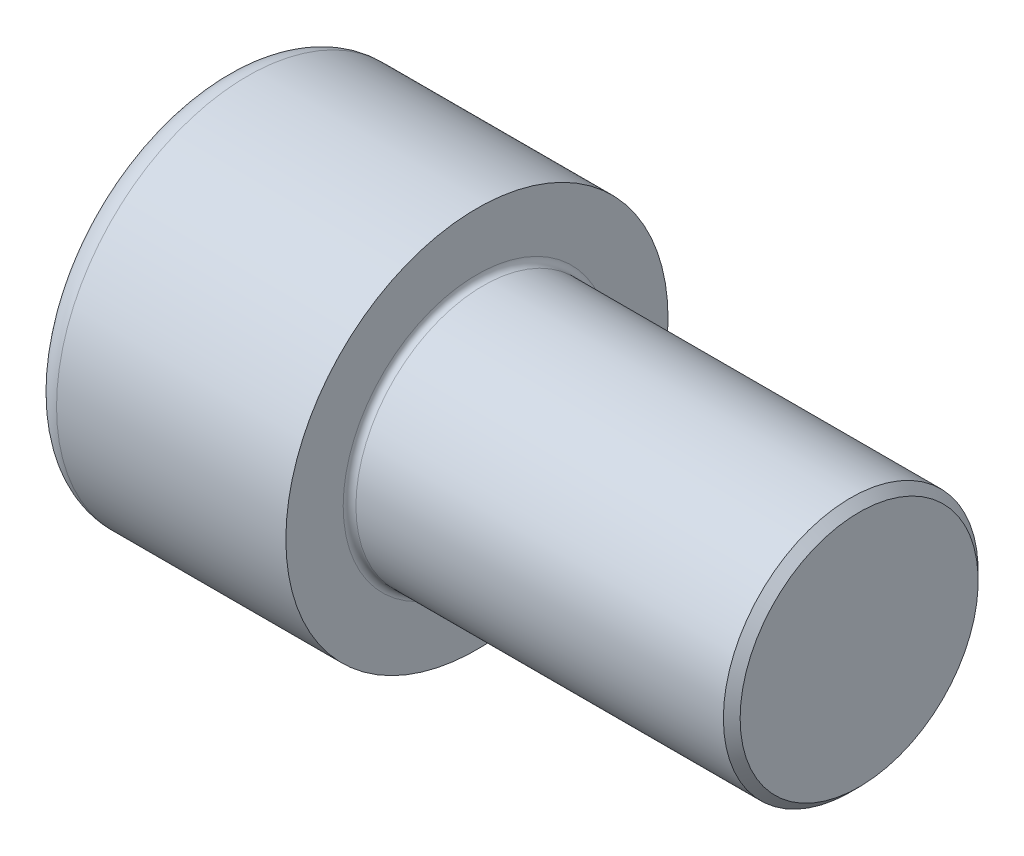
ISO-10303-21;
HEADER;
FILE_DESCRIPTION(('STEP AP214'),'2;1');
FILE_NAME('part.step','',(''),(''),'','','');
FILE_SCHEMA(('AUTOMOTIVE_DESIGN { 1 0 10303 214 1 1 1 1 }'));
ENDSEC;
DATA;
#1=APPLICATION_CONTEXT('core data for automotive mechanical design processes');
#2=APPLICATION_PROTOCOL_DEFINITION('international standard','automotive_design',2000,#1);
#3=PRODUCT_CONTEXT('',#1,'mechanical');
#4=PRODUCT('Part','Part','',(#3));
#5=PRODUCT_RELATED_PRODUCT_CATEGORY('part','',(#4));
#6=PRODUCT_DEFINITION_FORMATION('','',#4);
#7=PRODUCT_DEFINITION_CONTEXT('part definition',#1,'design');
#8=PRODUCT_DEFINITION('design','',#6,#7);
#9=PRODUCT_DEFINITION_SHAPE('','',#8);
#10=(LENGTH_UNIT() NAMED_UNIT(*) SI_UNIT(.MILLI.,.METRE.));
#11=(NAMED_UNIT(*) PLANE_ANGLE_UNIT() SI_UNIT($,.RADIAN.));
#12=(NAMED_UNIT(*) SI_UNIT($,.STERADIAN.) SOLID_ANGLE_UNIT());
#13=UNCERTAINTY_MEASURE_WITH_UNIT(LENGTH_MEASURE(1.E-05),#10,'distance_accuracy_value','');
#14=(GEOMETRIC_REPRESENTATION_CONTEXT(3) GLOBAL_UNCERTAINTY_ASSIGNED_CONTEXT((#13)) GLOBAL_UNIT_ASSIGNED_CONTEXT((#10,
#11,#12)) REPRESENTATION_CONTEXT('',''));
#15=CARTESIAN_POINT('',(0.,0.,0.));
#16=DIRECTION('',(0.,0.,1.));
#17=DIRECTION('',(1.,0.,0.));
#18=AXIS2_PLACEMENT_3D('',#15,#16,#17);
#19=CARTESIAN_POINT('',(0.,0.,0.));
#20=DIRECTION('',(-1.,0.,0.));
#21=DIRECTION('',(0.,0.,1.));
#22=AXIS2_PLACEMENT_3D('',#19,#20,#21);
#23=PLANE('',#22);
#24=DIRECTION('',(0.,-0.499999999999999,0.866025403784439));
#25=VECTOR('',#24,1.);
#26=CARTESIAN_POINT('',(0.,49.1440549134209,0.));
#27=LINE('',#26,#25);
#28=CARTESIAN_POINT('',(0.,49.1440549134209,0.));
#29=VERTEX_POINT('',#28);
#30=CARTESIAN_POINT('',(0.,24.5720274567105,42.56));
#31=VERTEX_POINT('',#30);
#32=EDGE_CURVE('E112',#29,#31,#27,.T.);
#33=ORIENTED_EDGE('',*,*,#32,.T.);
#34=DIRECTION('',(0.,1.,0.));
#35=VECTOR('',#34,1.);
#36=CARTESIAN_POINT('',(0.,-24.5720274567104,42.56));
#37=LINE('',#36,#35);
#38=CARTESIAN_POINT('',(0.,-24.5720274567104,42.56));
#39=VERTEX_POINT('',#38);
#40=EDGE_CURVE('E101',#39,#31,#37,.T.);
#41=ORIENTED_EDGE('',*,*,#40,.F.);
#42=DIRECTION('',(0.,-0.500000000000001,-0.866025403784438));
#43=VECTOR('',#42,1.);
#44=CARTESIAN_POINT('',(0.,-24.5720274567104,42.56));
#45=LINE('',#44,#43);
#46=CARTESIAN_POINT('',(0.,-49.1440549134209,0.));
#47=VERTEX_POINT('',#46);
#48=EDGE_CURVE('E111',#39,#47,#45,.T.);
#49=ORIENTED_EDGE('',*,*,#48,.T.);
#50=DIRECTION('',(0.,0.499999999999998,-0.86602540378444));
#51=VECTOR('',#50,1.);
#52=CARTESIAN_POINT('',(0.,-49.1440549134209,0.));
#53=LINE('',#52,#51);
#54=CARTESIAN_POINT('',(0.,-24.5720274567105,-42.56));
#55=VERTEX_POINT('',#54);
#56=EDGE_CURVE('E130',#47,#55,#53,.T.);
#57=ORIENTED_EDGE('',*,*,#56,.T.);
#58=DIRECTION('',(0.,-1.,0.));
#59=VECTOR('',#58,1.);
#60=CARTESIAN_POINT('',(0.,24.5720274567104,-42.56));
#61=LINE('',#60,#59);
#62=CARTESIAN_POINT('',(0.,24.5720274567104,-42.56));
#63=VERTEX_POINT('',#62);
#64=EDGE_CURVE('E133',#63,#55,#61,.T.);
#65=ORIENTED_EDGE('',*,*,#64,.F.);
#66=DIRECTION('',(0.,-0.500000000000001,-0.866025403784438));
#67=VECTOR('',#66,1.);
#68=CARTESIAN_POINT('',(0.,49.1440549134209,0.));
#69=LINE('',#68,#67);
#70=EDGE_CURVE('E126',#29,#63,#69,.T.);
#71=ORIENTED_EDGE('',*,*,#70,.F.);
#72=EDGE_LOOP('',(#33,#41,#49,#57,#65,#71));
#73=FACE_BOUND('',#72,.T.);
#74=CARTESIAN_POINT('',(0.,0.,0.));
#75=DIRECTION('',(-1.,0.,0.));
#76=DIRECTION('',(0.,0.,1.));
#77=AXIS2_PLACEMENT_3D('',#74,#75,#76);
#78=CIRCLE('',#77,65.);
#79=CARTESIAN_POINT('',(0.,0.,65.));
#80=VERTEX_POINT('',#79);
#81=EDGE_CURVE('E37',#80,#80,#78,.T.);
#82=ORIENTED_EDGE('',*,*,#81,.T.);
#83=EDGE_LOOP('',(#82));
#84=FACE_BOUND('',#83,.T.);
#85=ADVANCED_FACE('F30',(#73,#84),#23,.T.);
#86=CARTESIAN_POINT('',(-31.75,0.,0.));
#87=DIRECTION('',(-1.,0.,0.));
#88=DIRECTION('',(0.,0.,1.));
#89=AXIS2_PLACEMENT_3D('',#86,#87,#88);
#90=CYLINDRICAL_SURFACE('',#89,75.);
#91=CARTESIAN_POINT('',(10.,0.,0.));
#92=DIRECTION('',(-1.,0.,0.));
#93=DIRECTION('',(0.,0.,1.));
#94=AXIS2_PLACEMENT_3D('',#91,#92,#93);
#95=CIRCLE('',#94,75.);
#96=CARTESIAN_POINT('',(10.,0.,75.));
#97=VERTEX_POINT('',#96);
#98=EDGE_CURVE('E11',#97,#97,#95,.F.);
#99=ORIENTED_EDGE('',*,*,#98,.T.);
#100=EDGE_LOOP('',(#99));
#101=FACE_BOUND('',#100,.T.);
#102=CARTESIAN_POINT('',(100.,0.,0.));
#103=DIRECTION('',(-1.,0.,0.));
#104=DIRECTION('',(0.,0.,1.));
#105=AXIS2_PLACEMENT_3D('',#102,#103,#104);
#106=CIRCLE('',#105,75.);
#107=CARTESIAN_POINT('',(100.,0.,75.));
#108=VERTEX_POINT('',#107);
#109=EDGE_CURVE('E178',#108,#108,#106,.T.);
#110=ORIENTED_EDGE('',*,*,#109,.T.);
#111=EDGE_LOOP('',(#110));
#112=FACE_BOUND('',#111,.T.);
#113=ADVANCED_FACE('F205',(#101,#112),#90,.T.);
#114=CARTESIAN_POINT('',(100.,75.,0.));
#115=DIRECTION('',(1.,0.,0.));
#116=DIRECTION('',(0.,0.,-1.));
#117=AXIS2_PLACEMENT_3D('',#114,#115,#116);
#118=PLANE('',#117);
#119=CARTESIAN_POINT('',(100.,0.,0.));
#120=DIRECTION('',(1.,0.,0.));
#121=DIRECTION('',(0.,0.,-1.));
#122=AXIS2_PLACEMENT_3D('',#119,#120,#121);
#123=CIRCLE('',#122,52.5);
#124=CARTESIAN_POINT('',(100.,0.,-52.5));
#125=VERTEX_POINT('',#124);
#126=EDGE_CURVE('E181',#125,#125,#123,.F.);
#127=ORIENTED_EDGE('',*,*,#126,.T.);
#128=EDGE_LOOP('',(#127));
#129=FACE_BOUND('',#128,.T.);
#130=ORIENTED_EDGE('',*,*,#109,.F.);
#131=EDGE_LOOP('',(#130));
#132=FACE_BOUND('',#131,.T.);
#133=ADVANCED_FACE('F209',(#129,#132),#118,.T.);
#134=CARTESIAN_POINT('',(-31.75,0.,0.));
#135=DIRECTION('',(-1.,0.,0.));
#136=DIRECTION('',(0.,0.,1.));
#137=AXIS2_PLACEMENT_3D('',#134,#135,#136);
#138=CYLINDRICAL_SURFACE('',#137,50.);
#139=CARTESIAN_POINT('',(102.5,0.,0.));
#140=DIRECTION('',(1.,0.,0.));
#141=DIRECTION('',(0.,0.,-1.));
#142=AXIS2_PLACEMENT_3D('',#139,#140,#141);
#143=CIRCLE('',#142,50.);
#144=CARTESIAN_POINT('',(102.5,0.,-50.));
#145=VERTEX_POINT('',#144);
#146=EDGE_CURVE('E184',#145,#145,#143,.T.);
#147=ORIENTED_EDGE('',*,*,#146,.T.);
#148=EDGE_LOOP('',(#147));
#149=FACE_BOUND('',#148,.T.);
#150=CARTESIAN_POINT('',(246.7125,0.,0.));
#151=DIRECTION('',(-1.,0.,0.));
#152=DIRECTION('',(0.,0.,1.));
#153=AXIS2_PLACEMENT_3D('',#150,#151,#152);
#154=CIRCLE('',#153,50.);
#155=CARTESIAN_POINT('',(246.7125,0.,50.));
#156=VERTEX_POINT('',#155);
#157=EDGE_CURVE('E175',#156,#156,#154,.T.);
#158=ORIENTED_EDGE('',*,*,#157,.T.);
#159=EDGE_LOOP('',(#158));
#160=FACE_BOUND('',#159,.T.);
#161=ADVANCED_FACE('F214',(#149,#160),#138,.T.);
#162=CARTESIAN_POINT('',(250.,0.,0.));
#163=DIRECTION('',(-1.,0.,0.));
#164=DIRECTION('',(0.,0.,1.));
#165=AXIS2_PLACEMENT_3D('',#162,#163,#164);
#166=CONICAL_SURFACE('',#165,46.7125,0.785398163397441);
#167=ORIENTED_EDGE('',*,*,#157,.F.);
#168=EDGE_LOOP('',(#167));
#169=FACE_BOUND('',#168,.T.);
#170=CARTESIAN_POINT('',(250.,0.,0.));
#171=DIRECTION('',(-1.,0.,0.));
#172=DIRECTION('',(0.,0.,1.));
#173=AXIS2_PLACEMENT_3D('',#170,#171,#172);
#174=CIRCLE('',#173,46.7125);
#175=CARTESIAN_POINT('',(250.,0.,46.7125));
#176=VERTEX_POINT('',#175);
#177=EDGE_CURVE('E171',#176,#176,#174,.T.);
#178=ORIENTED_EDGE('',*,*,#177,.T.);
#179=EDGE_LOOP('',(#178));
#180=FACE_BOUND('',#179,.T.);
#181=ADVANCED_FACE('F221',(#169,#180),#166,.T.);
#182=CARTESIAN_POINT('',(250.,46.7125,0.));
#183=DIRECTION('',(1.,0.,0.));
#184=DIRECTION('',(0.,0.,-1.));
#185=AXIS2_PLACEMENT_3D('',#182,#183,#184);
#186=PLANE('',#185);
#187=ORIENTED_EDGE('',*,*,#177,.F.);
#188=EDGE_LOOP('',(#187));
#189=FACE_BOUND('',#188,.T.);
#190=ADVANCED_FACE('F199',(#189),#186,.T.);
#191=CARTESIAN_POINT('',(102.5,0.,0.));
#192=DIRECTION('',(1.,0.,0.));
#193=DIRECTION('',(0.,0.,-1.));
#194=AXIS2_PLACEMENT_3D('',#191,#192,#193);
#195=TOROIDAL_SURFACE('',#194,52.5,2.5);
#196=ORIENTED_EDGE('',*,*,#146,.F.);
#197=EDGE_LOOP('',(#196));
#198=FACE_BOUND('',#197,.T.);
#199=ORIENTED_EDGE('',*,*,#126,.F.);
#200=EDGE_LOOP('',(#199));
#201=FACE_BOUND('',#200,.T.);
#202=ADVANCED_FACE('F191',(#198,#201),#195,.F.);
#203=CARTESIAN_POINT('',(10.,0.,0.));
#204=DIRECTION('',(-1.,0.,0.));
#205=DIRECTION('',(0.,0.,1.));
#206=AXIS2_PLACEMENT_3D('',#203,#204,#205);
#207=TOROIDAL_SURFACE('',#206,65.,10.);
#208=ORIENTED_EDGE('',*,*,#98,.F.);
#209=EDGE_LOOP('',(#208));
#210=FACE_BOUND('',#209,.T.);
#211=ORIENTED_EDGE('',*,*,#81,.F.);
#212=EDGE_LOOP('',(#211));
#213=FACE_BOUND('',#212,.T.);
#214=ADVANCED_FACE('F189',(#210,#213),#207,.T.);
#215=CARTESIAN_POINT('',(60.,49.1440549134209,0.));
#216=DIRECTION('',(0.,-0.866025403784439,-0.499999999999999));
#217=DIRECTION('',(0.,0.499999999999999,-0.866025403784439));
#218=AXIS2_PLACEMENT_3D('',#215,#216,#217);
#219=PLANE('',#218);
#220=ORIENTED_EDGE('',*,*,#32,.F.);
#221=DIRECTION('',(-1.,0.,0.));
#222=VECTOR('',#221,1.);
#223=CARTESIAN_POINT('',(60.,49.1440549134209,0.));
#224=LINE('',#223,#222);
#225=CARTESIAN_POINT('',(60.,49.1440549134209,0.));
#226=VERTEX_POINT('',#225);
#227=EDGE_CURVE('E156',#226,#29,#224,.T.);
#228=ORIENTED_EDGE('',*,*,#227,.F.);
#229=DIRECTION('',(0.,-0.499999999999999,0.866025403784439));
#230=VECTOR('',#229,1.);
#231=CARTESIAN_POINT('',(60.,49.1440549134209,0.));
#232=LINE('',#231,#230);
#233=CARTESIAN_POINT('',(60.,36.8580411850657,21.2799999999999));
#234=VERTEX_POINT('',#233);
#235=EDGE_CURVE('E136',#226,#234,#232,.T.);
#236=ORIENTED_EDGE('',*,*,#235,.T.);
#237=CARTESIAN_POINT('',(60.,24.5720274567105,42.56));
#238=VERTEX_POINT('',#237);
#239=EDGE_CURVE('E120',#234,#238,#232,.T.);
#240=ORIENTED_EDGE('',*,*,#239,.T.);
#241=DIRECTION('',(-1.,0.,0.));
#242=VECTOR('',#241,1.);
#243=CARTESIAN_POINT('',(60.,24.5720274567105,42.56));
#244=LINE('',#243,#242);
#245=EDGE_CURVE('E105',#238,#31,#244,.T.);
#246=ORIENTED_EDGE('',*,*,#245,.T.);
#247=EDGE_LOOP('',(#220,#228,#236,#240,#246));
#248=FACE_BOUND('',#247,.T.);
#249=ADVANCED_FACE('F116',(#248),#219,.T.);
#250=CARTESIAN_POINT('',(60.,-24.5720274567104,42.56));
#251=DIRECTION('',(0.,0.,1.));
#252=DIRECTION('',(0.,-1.,0.));
#253=AXIS2_PLACEMENT_3D('',#250,#251,#252);
#254=PLANE('',#253);
#255=ORIENTED_EDGE('',*,*,#40,.T.);
#256=ORIENTED_EDGE('',*,*,#245,.F.);
#257=DIRECTION('',(0.,1.,0.));
#258=VECTOR('',#257,1.);
#259=CARTESIAN_POINT('',(60.,-24.5720274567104,42.56));
#260=LINE('',#259,#258);
#261=CARTESIAN_POINT('',(60.,0.,42.56));
#262=VERTEX_POINT('',#261);
#263=EDGE_CURVE('E138',#262,#238,#260,.T.);
#264=ORIENTED_EDGE('',*,*,#263,.F.);
#265=CARTESIAN_POINT('',(60.,-24.5720274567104,42.56));
#266=VERTEX_POINT('',#265);
#267=EDGE_CURVE('E139',#266,#262,#260,.T.);
#268=ORIENTED_EDGE('',*,*,#267,.F.);
#269=DIRECTION('',(-1.,0.,0.));
#270=VECTOR('',#269,1.);
#271=CARTESIAN_POINT('',(60.,-24.5720274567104,42.56));
#272=LINE('',#271,#270);
#273=EDGE_CURVE('E107',#266,#39,#272,.T.);
#274=ORIENTED_EDGE('',*,*,#273,.T.);
#275=EDGE_LOOP('',(#255,#256,#264,#268,#274));
#276=FACE_BOUND('',#275,.T.);
#277=ADVANCED_FACE('F103',(#276),#254,.F.);
#278=CARTESIAN_POINT('',(60.,-24.5720274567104,42.56));
#279=DIRECTION('',(0.,0.866025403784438,-0.500000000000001));
#280=DIRECTION('',(0.,0.500000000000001,0.866025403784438));
#281=AXIS2_PLACEMENT_3D('',#278,#279,#280);
#282=PLANE('',#281);
#283=ORIENTED_EDGE('',*,*,#48,.F.);
#284=ORIENTED_EDGE('',*,*,#273,.F.);
#285=DIRECTION('',(0.,-0.500000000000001,-0.866025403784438));
#286=VECTOR('',#285,1.);
#287=CARTESIAN_POINT('',(60.,-24.5720274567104,42.56));
#288=LINE('',#287,#286);
#289=CARTESIAN_POINT('',(60.,-36.8580411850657,21.28));
#290=VERTEX_POINT('',#289);
#291=EDGE_CURVE('E143',#266,#290,#288,.T.);
#292=ORIENTED_EDGE('',*,*,#291,.T.);
#293=CARTESIAN_POINT('',(60.,-49.1440549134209,0.));
#294=VERTEX_POINT('',#293);
#295=EDGE_CURVE('E142',#290,#294,#288,.T.);
#296=ORIENTED_EDGE('',*,*,#295,.T.);
#297=DIRECTION('',(-1.,0.,0.));
#298=VECTOR('',#297,1.);
#299=CARTESIAN_POINT('',(60.,-49.1440549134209,0.));
#300=LINE('',#299,#298);
#301=EDGE_CURVE('E164',#294,#47,#300,.T.);
#302=ORIENTED_EDGE('',*,*,#301,.T.);
#303=EDGE_LOOP('',(#283,#284,#292,#296,#302));
#304=FACE_BOUND('',#303,.T.);
#305=ADVANCED_FACE('F271',(#304),#282,.T.);
#306=CARTESIAN_POINT('',(60.,-49.1440549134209,0.));
#307=DIRECTION('',(0.,0.86602540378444,0.499999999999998));
#308=DIRECTION('',(0.,-0.499999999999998,0.86602540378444));
#309=AXIS2_PLACEMENT_3D('',#306,#307,#308);
#310=PLANE('',#309);
#311=ORIENTED_EDGE('',*,*,#56,.F.);
#312=ORIENTED_EDGE('',*,*,#301,.F.);
#313=DIRECTION('',(0.,0.499999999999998,-0.86602540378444));
#314=VECTOR('',#313,1.);
#315=CARTESIAN_POINT('',(60.,-49.1440549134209,0.));
#316=LINE('',#315,#314);
#317=CARTESIAN_POINT('',(60.,-36.8580411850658,-21.2799999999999));
#318=VERTEX_POINT('',#317);
#319=EDGE_CURVE('E147',#294,#318,#316,.T.);
#320=ORIENTED_EDGE('',*,*,#319,.T.);
#321=CARTESIAN_POINT('',(60.,-24.5720274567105,-42.56));
#322=VERTEX_POINT('',#321);
#323=EDGE_CURVE('E146',#318,#322,#316,.T.);
#324=ORIENTED_EDGE('',*,*,#323,.T.);
#325=DIRECTION('',(-1.,0.,0.));
#326=VECTOR('',#325,1.);
#327=CARTESIAN_POINT('',(60.,-24.5720274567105,-42.56));
#328=LINE('',#327,#326);
#329=EDGE_CURVE('E161',#322,#55,#328,.T.);
#330=ORIENTED_EDGE('',*,*,#329,.T.);
#331=EDGE_LOOP('',(#311,#312,#320,#324,#330));
#332=FACE_BOUND('',#331,.T.);
#333=ADVANCED_FACE('F280',(#332),#310,.T.);
#334=CARTESIAN_POINT('',(60.,24.5720274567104,-42.56));
#335=DIRECTION('',(0.,0.,-1.));
#336=DIRECTION('',(0.,1.,0.));
#337=AXIS2_PLACEMENT_3D('',#334,#335,#336);
#338=PLANE('',#337);
#339=ORIENTED_EDGE('',*,*,#64,.T.);
#340=ORIENTED_EDGE('',*,*,#329,.F.);
#341=DIRECTION('',(0.,-1.,0.));
#342=VECTOR('',#341,1.);
#343=CARTESIAN_POINT('',(60.,24.5720274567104,-42.56));
#344=LINE('',#343,#342);
#345=CARTESIAN_POINT('',(60.,0.,-42.56));
#346=VERTEX_POINT('',#345);
#347=EDGE_CURVE('E150',#346,#322,#344,.T.);
#348=ORIENTED_EDGE('',*,*,#347,.F.);
#349=CARTESIAN_POINT('',(60.,24.5720274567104,-42.56));
#350=VERTEX_POINT('',#349);
#351=EDGE_CURVE('E44',#350,#346,#344,.T.);
#352=ORIENTED_EDGE('',*,*,#351,.F.);
#353=DIRECTION('',(-1.,0.,0.));
#354=VECTOR('',#353,1.);
#355=CARTESIAN_POINT('',(60.,24.5720274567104,-42.56));
#356=LINE('',#355,#354);
#357=EDGE_CURVE('E158',#350,#63,#356,.T.);
#358=ORIENTED_EDGE('',*,*,#357,.T.);
#359=EDGE_LOOP('',(#339,#340,#348,#352,#358));
#360=FACE_BOUND('',#359,.T.);
#361=ADVANCED_FACE('F290',(#360),#338,.F.);
#362=CARTESIAN_POINT('',(60.,49.1440549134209,0.));
#363=DIRECTION('',(0.,0.866025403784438,-0.500000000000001));
#364=DIRECTION('',(0.,0.500000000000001,0.866025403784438));
#365=AXIS2_PLACEMENT_3D('',#362,#363,#364);
#366=PLANE('',#365);
#367=ORIENTED_EDGE('',*,*,#70,.T.);
#368=ORIENTED_EDGE('',*,*,#357,.F.);
#369=DIRECTION('',(0.,-0.500000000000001,-0.866025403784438));
#370=VECTOR('',#369,1.);
#371=CARTESIAN_POINT('',(60.,49.1440549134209,0.));
#372=LINE('',#371,#370);
#373=CARTESIAN_POINT('',(60.,36.8580411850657,-21.28));
#374=VERTEX_POINT('',#373);
#375=EDGE_CURVE('E152',#374,#350,#372,.T.);
#376=ORIENTED_EDGE('',*,*,#375,.F.);
#377=EDGE_CURVE('E153',#226,#374,#372,.T.);
#378=ORIENTED_EDGE('',*,*,#377,.F.);
#379=ORIENTED_EDGE('',*,*,#227,.T.);
#380=EDGE_LOOP('',(#367,#368,#376,#378,#379));
#381=FACE_BOUND('',#380,.T.);
#382=ADVANCED_FACE('F300',(#381),#366,.F.);
#383=CARTESIAN_POINT('',(60.,73.7160823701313,-42.5600000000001));
#384=DIRECTION('',(1.,0.,0.));
#385=DIRECTION('',(0.,0.,-1.));
#386=AXIS2_PLACEMENT_3D('',#383,#384,#385);
#387=PLANE('',#386);
#388=ORIENTED_EDGE('',*,*,#347,.T.);
#389=ORIENTED_EDGE('',*,*,#323,.F.);
#390=CARTESIAN_POINT('',(60.,0.,0.));
#391=DIRECTION('',(-1.,0.,0.));
#392=DIRECTION('',(0.,0.,1.));
#393=AXIS2_PLACEMENT_3D('',#390,#391,#392);
#394=CIRCLE('',#393,42.56);
#395=EDGE_CURVE('E386',#346,#318,#394,.T.);
#396=ORIENTED_EDGE('',*,*,#395,.F.);
#397=EDGE_LOOP('',(#388,#389,#396));
#398=FACE_BOUND('',#397,.T.);
#399=ADVANCED_FACE('F310',(#398),#387,.F.);
#400=ORIENTED_EDGE('',*,*,#319,.F.);
#401=ORIENTED_EDGE('',*,*,#295,.F.);
#402=EDGE_CURVE('E384',#318,#290,#394,.T.);
#403=ORIENTED_EDGE('',*,*,#402,.F.);
#404=EDGE_LOOP('',(#400,#401,#403));
#405=FACE_BOUND('',#404,.T.);
#406=ADVANCED_FACE('F320',(#405),#387,.F.);
#407=ORIENTED_EDGE('',*,*,#291,.F.);
#408=ORIENTED_EDGE('',*,*,#267,.T.);
#409=EDGE_CURVE('E121',#290,#262,#394,.T.);
#410=ORIENTED_EDGE('',*,*,#409,.F.);
#411=EDGE_LOOP('',(#407,#408,#410));
#412=FACE_BOUND('',#411,.T.);
#413=ADVANCED_FACE('F331',(#412),#387,.F.);
#414=ORIENTED_EDGE('',*,*,#263,.T.);
#415=ORIENTED_EDGE('',*,*,#239,.F.);
#416=EDGE_CURVE('E168',#262,#234,#394,.T.);
#417=ORIENTED_EDGE('',*,*,#416,.F.);
#418=EDGE_LOOP('',(#414,#415,#417));
#419=FACE_BOUND('',#418,.T.);
#420=ADVANCED_FACE('F340',(#419),#387,.F.);
#421=ORIENTED_EDGE('',*,*,#235,.F.);
#422=ORIENTED_EDGE('',*,*,#377,.T.);
#423=EDGE_CURVE('E172',#234,#374,#394,.T.);
#424=ORIENTED_EDGE('',*,*,#423,.F.);
#425=EDGE_LOOP('',(#421,#422,#424));
#426=FACE_BOUND('',#425,.T.);
#427=ADVANCED_FACE('F349',(#426),#387,.F.);
#428=ORIENTED_EDGE('',*,*,#375,.T.);
#429=ORIENTED_EDGE('',*,*,#351,.T.);
#430=EDGE_CURVE('E389',#374,#346,#394,.T.);
#431=ORIENTED_EDGE('',*,*,#430,.F.);
#432=EDGE_LOOP('',(#428,#429,#431));
#433=FACE_BOUND('',#432,.T.);
#434=ADVANCED_FACE('F323',(#433),#387,.F.);
#435=CARTESIAN_POINT('',(60.,0.,0.));
#436=DIRECTION('',(-1.,0.,0.));
#437=DIRECTION('',(0.,0.,1.));
#438=AXIS2_PLACEMENT_3D('',#435,#436,#437);
#439=CONICAL_SURFACE('',#438,42.56,1.04719755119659);
#440=CARTESIAN_POINT('',(84.5720274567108,0.,0.));
#441=VERTEX_POINT('',#440);
#442=VERTEX_LOOP('',#441);
#443=FACE_BOUND('',#442,.T.);
#444=ORIENTED_EDGE('',*,*,#416,.T.);
#445=ORIENTED_EDGE('',*,*,#423,.T.);
#446=ORIENTED_EDGE('',*,*,#430,.T.);
#447=ORIENTED_EDGE('',*,*,#395,.T.);
#448=ORIENTED_EDGE('',*,*,#402,.T.);
#449=ORIENTED_EDGE('',*,*,#409,.T.);
#450=EDGE_LOOP('',(#444,#445,#446,#447,#448,#449));
#451=FACE_BOUND('',#450,.T.);
#452=ADVANCED_FACE('F366',(#443,#451),#439,.F.);
#453=CLOSED_SHELL('',(#85,#113,#133,#161,#181,#190,#202,#214,#249,#277,#305,#333,#361,#382,#399,
#406,#413,#420,#427,#434,#452));
#454=MANIFOLD_SOLID_BREP('B2',#453);
#455=ADVANCED_BREP_SHAPE_REPRESENTATION('',(#18,#454),#14);
#456=SHAPE_DEFINITION_REPRESENTATION(#9,#455);
ENDSEC;
END-ISO-10303-21;
